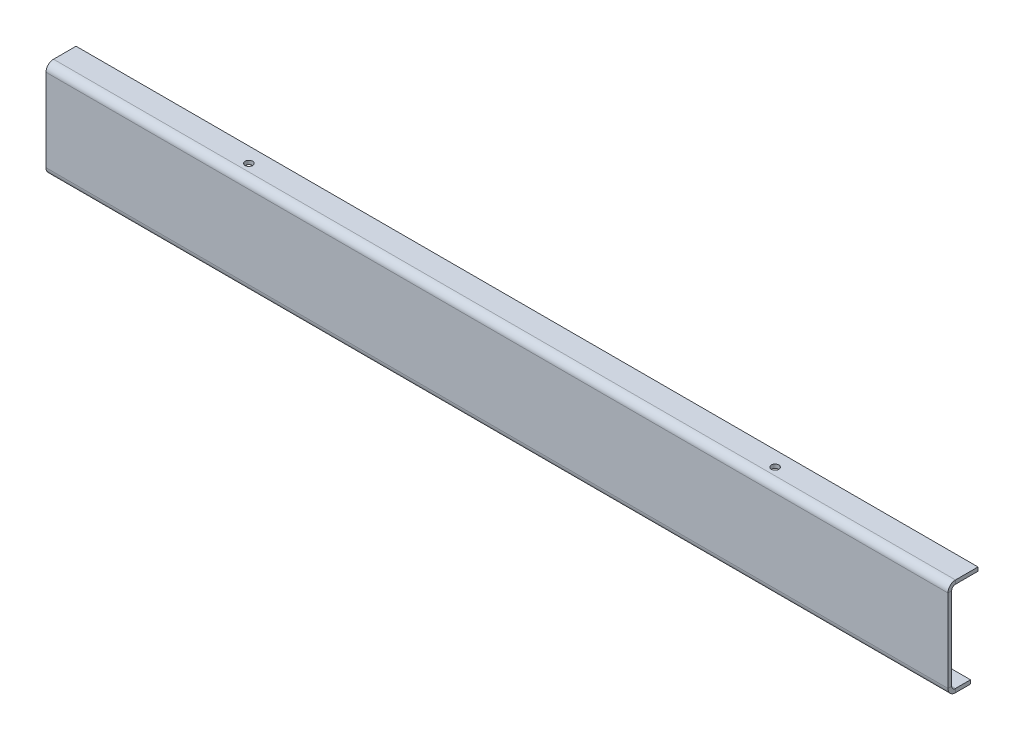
ISO-10303-21;
HEADER;
FILE_DESCRIPTION(('STEP AP214'),'2;1');
FILE_NAME('part.step','',(''),(''),'','','');
FILE_SCHEMA(('AUTOMOTIVE_DESIGN { 1 0 10303 214 1 1 1 1 }'));
ENDSEC;
DATA;
#1=APPLICATION_CONTEXT('core data for automotive mechanical design processes');
#2=APPLICATION_PROTOCOL_DEFINITION('international standard','automotive_design',2000,#1);
#3=PRODUCT_CONTEXT('',#1,'mechanical');
#4=PRODUCT('Part','Part','',(#3));
#5=PRODUCT_RELATED_PRODUCT_CATEGORY('part','',(#4));
#6=PRODUCT_DEFINITION_FORMATION('','',#4);
#7=PRODUCT_DEFINITION_CONTEXT('part definition',#1,'design');
#8=PRODUCT_DEFINITION('design','',#6,#7);
#9=PRODUCT_DEFINITION_SHAPE('','',#8);
#10=(LENGTH_UNIT() NAMED_UNIT(*) SI_UNIT(.MILLI.,.METRE.));
#11=(NAMED_UNIT(*) PLANE_ANGLE_UNIT() SI_UNIT($,.RADIAN.));
#12=(NAMED_UNIT(*) SI_UNIT($,.STERADIAN.) SOLID_ANGLE_UNIT());
#13=UNCERTAINTY_MEASURE_WITH_UNIT(LENGTH_MEASURE(1.E-05),#10,'distance_accuracy_value','');
#14=(GEOMETRIC_REPRESENTATION_CONTEXT(3) GLOBAL_UNCERTAINTY_ASSIGNED_CONTEXT((#13)) GLOBAL_UNIT_ASSIGNED_CONTEXT((#10,
#11,#12)) REPRESENTATION_CONTEXT('',''));
#15=CARTESIAN_POINT('',(0.,0.,0.));
#16=DIRECTION('',(0.,0.,1.));
#17=DIRECTION('',(1.,0.,0.));
#18=AXIS2_PLACEMENT_3D('',#15,#16,#17);
#19=CARTESIAN_POINT('',(299.999999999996,32.5000000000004,-19.9999999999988));
#20=DIRECTION('',(0.,-1.,0.));
#21=DIRECTION('',(0.,0.,-1.00000000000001));
#22=AXIS2_PLACEMENT_3D('',#19,#20,#21);
#23=PLANE('',#22);
#24=CARTESIAN_POINT('',(-175.000000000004,32.5,-10.000000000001));
#25=DIRECTION('',(0.,1.,0.));
#26=DIRECTION('',(0.,0.,1.00000000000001));
#27=AXIS2_PLACEMENT_3D('',#24,#25,#26);
#28=CIRCLE('',#27,2.5);
#29=CARTESIAN_POINT('',(-175.000000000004,32.5,-7.50000000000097));
#30=VERTEX_POINT('',#29);
#31=EDGE_CURVE('E627',#30,#30,#28,.T.);
#32=ORIENTED_EDGE('',*,*,#31,.F.);
#33=EDGE_LOOP('',(#32));
#34=FACE_BOUND('',#33,.T.);
#35=DIRECTION('',(0.,0.,1.00000000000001));
#36=VECTOR('',#35,1.);
#37=CARTESIAN_POINT('',(-300.000000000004,32.5000000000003,-20.0000000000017));
#38=LINE('',#37,#36);
#39=CARTESIAN_POINT('',(-300.000000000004,32.5000000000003,-20.0000000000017));
#40=VERTEX_POINT('',#39);
#41=CARTESIAN_POINT('',(-300.000000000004,32.5000000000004,-5.00000000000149));
#42=VERTEX_POINT('',#41);
#43=EDGE_CURVE('E187',#40,#42,#38,.T.);
#44=ORIENTED_EDGE('',*,*,#43,.T.);
#45=DIRECTION('',(-1.,0.,0.));
#46=VECTOR('',#45,1.);
#47=CARTESIAN_POINT('',(300.,32.5000000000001,-4.99999999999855));
#48=LINE('',#47,#46);
#49=CARTESIAN_POINT('',(300.,32.5000000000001,-4.99999999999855));
#50=VERTEX_POINT('',#49);
#51=EDGE_CURVE('E254',#50,#42,#48,.T.);
#52=ORIENTED_EDGE('',*,*,#51,.F.);
#53=DIRECTION('',(0.,0.,1.00000000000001));
#54=VECTOR('',#53,1.);
#55=CARTESIAN_POINT('',(299.999999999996,32.5000000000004,-19.9999999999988));
#56=LINE('',#55,#54);
#57=CARTESIAN_POINT('',(299.999999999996,32.5000000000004,-19.9999999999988));
#58=VERTEX_POINT('',#57);
#59=EDGE_CURVE('E230',#58,#50,#56,.T.);
#60=ORIENTED_EDGE('',*,*,#59,.F.);
#61=DIRECTION('',(-1.,0.,0.));
#62=VECTOR('',#61,1.);
#63=CARTESIAN_POINT('',(299.999999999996,32.5000000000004,-19.9999999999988));
#64=LINE('',#63,#62);
#65=EDGE_CURVE('E258',#58,#40,#64,.T.);
#66=ORIENTED_EDGE('',*,*,#65,.T.);
#67=EDGE_LOOP('',(#44,#52,#60,#66));
#68=FACE_BOUND('',#67,.T.);
#69=CARTESIAN_POINT('',(175.,32.5000000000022,-9.99999999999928));
#70=DIRECTION('',(0.,1.,0.));
#71=DIRECTION('',(0.,0.,1.00000000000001));
#72=AXIS2_PLACEMENT_3D('',#69,#70,#71);
#73=CIRCLE('',#72,2.5);
#74=CARTESIAN_POINT('',(175.,32.5000000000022,-7.49999999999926));
#75=VERTEX_POINT('',#74);
#76=EDGE_CURVE('E632',#75,#75,#73,.T.);
#77=ORIENTED_EDGE('',*,*,#76,.F.);
#78=EDGE_LOOP('',(#77));
#79=FACE_BOUND('',#78,.T.);
#80=ADVANCED_FACE('F42',(#34,#68,#79),#23,.F.);
#81=CARTESIAN_POINT('',(300.,32.5000000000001,-4.99999999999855));
#82=DIRECTION('',(1.,0.,0.));
#83=DIRECTION('',(0.,0.,-1.00000000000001));
#84=AXIS2_PLACEMENT_3D('',#81,#82,#83);
#85=PLANE('',#84);
#86=DIRECTION('',(0.,-1.,0.));
#87=VECTOR('',#86,1.);
#88=CARTESIAN_POINT('',(300.,32.5000000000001,-4.99999999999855));
#89=LINE('',#88,#87);
#90=CARTESIAN_POINT('',(300.,30.,-4.99999999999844));
#91=VERTEX_POINT('',#90);
#92=EDGE_CURVE('E11',#50,#91,#89,.T.);
#93=ORIENTED_EDGE('',*,*,#92,.F.);
#94=CARTESIAN_POINT('',(300.,27.5,-4.99999999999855));
#95=DIRECTION('',(-1.,0.,0.));
#96=DIRECTION('',(0.,0.,1.00000000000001));
#97=AXIS2_PLACEMENT_3D('',#94,#95,#96);
#98=CIRCLE('',#97,5.);
#99=CARTESIAN_POINT('',(300.,27.5000000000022,1.42247325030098E-12));
#100=VERTEX_POINT('',#99);
#101=EDGE_CURVE('E234',#50,#100,#98,.F.);
#102=ORIENTED_EDGE('',*,*,#101,.T.);
#103=DIRECTION('',(0.,0.,1.00000000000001));
#104=VECTOR('',#103,1.);
#105=CARTESIAN_POINT('',(300.,27.5000000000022,-2.49999999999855));
#106=LINE('',#105,#104);
#107=CARTESIAN_POINT('',(300.,27.5000000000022,-2.49999999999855));
#108=VERTEX_POINT('',#107);
#109=EDGE_CURVE('E51',#108,#100,#106,.T.);
#110=ORIENTED_EDGE('',*,*,#109,.F.);
#111=CARTESIAN_POINT('',(300.,27.5,-4.99999999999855));
#112=DIRECTION('',(1.,0.,0.));
#113=DIRECTION('',(0.,-1.,0.));
#114=AXIS2_PLACEMENT_3D('',#111,#112,#113);
#115=CIRCLE('',#114,2.5);
#116=EDGE_CURVE('E218',#91,#108,#115,.T.);
#117=ORIENTED_EDGE('',*,*,#116,.F.);
#118=EDGE_LOOP('',(#93,#102,#110,#117));
#119=FACE_BOUND('',#118,.T.);
#120=ADVANCED_FACE('F44',(#119),#85,.T.);
#121=CARTESIAN_POINT('',(300.,27.5000000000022,-2.49999999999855));
#122=DIRECTION('',(1.,0.,0.));
#123=DIRECTION('',(0.,0.,-1.00000000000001));
#124=AXIS2_PLACEMENT_3D('',#121,#122,#123);
#125=PLANE('',#124);
#126=ORIENTED_EDGE('',*,*,#59,.T.);
#127=ORIENTED_EDGE('',*,*,#92,.T.);
#128=DIRECTION('',(0.,0.,-1.00000000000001));
#129=VECTOR('',#128,1.);
#130=CARTESIAN_POINT('',(299.999999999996,30.0000000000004,-19.9999999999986));
#131=LINE('',#130,#129);
#132=CARTESIAN_POINT('',(299.999999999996,30.0000000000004,-19.9999999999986));
#133=VERTEX_POINT('',#132);
#134=EDGE_CURVE('E222',#133,#91,#131,.F.);
#135=ORIENTED_EDGE('',*,*,#134,.F.);
#136=DIRECTION('',(0.,-1.,0.));
#137=VECTOR('',#136,1.);
#138=CARTESIAN_POINT('',(299.999999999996,32.5000000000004,-19.9999999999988));
#139=LINE('',#138,#137);
#140=EDGE_CURVE('E226',#58,#133,#139,.T.);
#141=ORIENTED_EDGE('',*,*,#140,.F.);
#142=EDGE_LOOP('',(#126,#127,#135,#141));
#143=FACE_BOUND('',#142,.T.);
#144=ADVANCED_FACE('F339',(#143),#125,.T.);
#145=CARTESIAN_POINT('',(-300.000000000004,27.5000000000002,-1.45716771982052E-12));
#146=DIRECTION('',(-1.,0.,0.));
#147=DIRECTION('',(0.,0.,1.00000000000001));
#148=AXIS2_PLACEMENT_3D('',#145,#146,#147);
#149=PLANE('',#148);
#150=DIRECTION('',(0.,0.,-1.00000000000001));
#151=VECTOR('',#150,1.);
#152=CARTESIAN_POINT('',(-300.000000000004,27.5000000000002,-1.45716771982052E-12));
#153=LINE('',#152,#151);
#154=CARTESIAN_POINT('',(-300.000000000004,27.5000000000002,-1.45716771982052E-12));
#155=VERTEX_POINT('',#154);
#156=CARTESIAN_POINT('',(-300.000000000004,27.5000000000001,-2.50000000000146));
#157=VERTEX_POINT('',#156);
#158=EDGE_CURVE('E294',#155,#157,#153,.T.);
#159=ORIENTED_EDGE('',*,*,#158,.F.);
#160=CARTESIAN_POINT('',(-300.000000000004,27.5000000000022,-5.00000000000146));
#161=DIRECTION('',(-1.,0.,0.));
#162=DIRECTION('',(0.,0.,1.00000000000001));
#163=AXIS2_PLACEMENT_3D('',#160,#161,#162);
#164=CIRCLE('',#163,5.);
#165=EDGE_CURVE('E191',#42,#155,#164,.F.);
#166=ORIENTED_EDGE('',*,*,#165,.F.);
#167=DIRECTION('',(0.,1.,0.));
#168=VECTOR('',#167,1.);
#169=CARTESIAN_POINT('',(-300.000000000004,30.0000000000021,-5.00000000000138));
#170=LINE('',#169,#168);
#171=CARTESIAN_POINT('',(-300.000000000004,30.0000000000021,-5.00000000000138));
#172=VERTEX_POINT('',#171);
#173=EDGE_CURVE('E291',#172,#42,#170,.T.);
#174=ORIENTED_EDGE('',*,*,#173,.F.);
#175=CARTESIAN_POINT('',(-300.000000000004,27.5000000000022,-5.00000000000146));
#176=DIRECTION('',(1.,0.,0.));
#177=DIRECTION('',(0.,-1.,0.));
#178=AXIS2_PLACEMENT_3D('',#175,#176,#177);
#179=CIRCLE('',#178,2.5);
#180=EDGE_CURVE('E175',#172,#157,#179,.T.);
#181=ORIENTED_EDGE('',*,*,#180,.T.);
#182=EDGE_LOOP('',(#159,#166,#174,#181));
#183=FACE_BOUND('',#182,.T.);
#184=ADVANCED_FACE('F349',(#183),#149,.T.);
#185=CARTESIAN_POINT('',(-300.000000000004,30.0000000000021,-5.00000000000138));
#186=DIRECTION('',(-1.,0.,0.));
#187=DIRECTION('',(0.,0.,1.00000000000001));
#188=AXIS2_PLACEMENT_3D('',#185,#186,#187);
#189=PLANE('',#188);
#190=DIRECTION('',(0.,-1.,0.));
#191=VECTOR('',#190,1.);
#192=CARTESIAN_POINT('',(-300.000000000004,32.5000000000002,-1.48492329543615E-12));
#193=LINE('',#192,#191);
#194=CARTESIAN_POINT('',(-300.000000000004,-27.4999999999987,-1.37390099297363E-12));
#195=VERTEX_POINT('',#194);
#196=EDGE_CURVE('E195',#155,#195,#193,.T.);
#197=ORIENTED_EDGE('',*,*,#196,.F.);
#198=ORIENTED_EDGE('',*,*,#158,.T.);
#199=DIRECTION('',(0.,-1.,0.));
#200=VECTOR('',#199,1.);
#201=CARTESIAN_POINT('',(-300.000000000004,32.5000000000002,-2.50000000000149));
#202=LINE('',#201,#200);
#203=CARTESIAN_POINT('',(-300.000000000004,-27.4999999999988,-2.50000000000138));
#204=VERTEX_POINT('',#203);
#205=EDGE_CURVE('E171',#157,#204,#202,.T.);
#206=ORIENTED_EDGE('',*,*,#205,.T.);
#207=DIRECTION('',(0.,0.,1.00000000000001));
#208=VECTOR('',#207,1.);
#209=CARTESIAN_POINT('',(-300.000000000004,-27.4999999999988,-2.50000000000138));
#210=LINE('',#209,#208);
#211=EDGE_CURVE('E143',#204,#195,#210,.T.);
#212=ORIENTED_EDGE('',*,*,#211,.T.);
#213=EDGE_LOOP('',(#197,#198,#206,#212));
#214=FACE_BOUND('',#213,.T.);
#215=ADVANCED_FACE('F351',(#214),#189,.T.);
#216=CARTESIAN_POINT('',(300.,-27.4999999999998,1.5334955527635E-12));
#217=DIRECTION('',(1.,0.,0.));
#218=DIRECTION('',(0.,0.,-1.00000000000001));
#219=AXIS2_PLACEMENT_3D('',#216,#217,#218);
#220=PLANE('',#219);
#221=DIRECTION('',(0.,0.,-1.00000000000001));
#222=VECTOR('',#221,1.);
#223=CARTESIAN_POINT('',(300.,-27.4999999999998,1.5334955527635E-12));
#224=LINE('',#223,#222);
#225=CARTESIAN_POINT('',(300.,-27.4999999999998,1.5334955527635E-12));
#226=VERTEX_POINT('',#225);
#227=CARTESIAN_POINT('',(300.,-27.4999999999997,-2.49999999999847));
#228=VERTEX_POINT('',#227);
#229=EDGE_CURVE('E65',#226,#228,#224,.T.);
#230=ORIENTED_EDGE('',*,*,#229,.F.);
#231=CARTESIAN_POINT('',(300.,-27.4999999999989,-4.99999999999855));
#232=DIRECTION('',(-1.,0.,0.));
#233=DIRECTION('',(0.,0.,1.00000000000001));
#234=AXIS2_PLACEMENT_3D('',#231,#232,#233);
#235=CIRCLE('',#234,5.);
#236=CARTESIAN_POINT('',(300.,-32.4999999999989,-4.99999999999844));
#237=VERTEX_POINT('',#236);
#238=EDGE_CURVE('E241',#226,#237,#235,.F.);
#239=ORIENTED_EDGE('',*,*,#238,.T.);
#240=DIRECTION('',(0.,-1.,0.));
#241=VECTOR('',#240,1.);
#242=CARTESIAN_POINT('',(300.,-29.9999999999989,-4.99999999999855));
#243=LINE('',#242,#241);
#244=CARTESIAN_POINT('',(300.,-29.9999999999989,-4.99999999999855));
#245=VERTEX_POINT('',#244);
#246=EDGE_CURVE('E58',#245,#237,#243,.T.);
#247=ORIENTED_EDGE('',*,*,#246,.F.);
#248=CARTESIAN_POINT('',(300.,-27.4999999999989,-4.99999999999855));
#249=DIRECTION('',(1.,0.,0.));
#250=DIRECTION('',(0.,-1.,0.));
#251=AXIS2_PLACEMENT_3D('',#248,#249,#250);
#252=CIRCLE('',#251,2.5);
#253=EDGE_CURVE('E211',#228,#245,#252,.T.);
#254=ORIENTED_EDGE('',*,*,#253,.F.);
#255=EDGE_LOOP('',(#230,#239,#247,#254));
#256=FACE_BOUND('',#255,.T.);
#257=ADVANCED_FACE('F317',(#256),#220,.T.);
#258=CARTESIAN_POINT('',(300.,-29.9999999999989,-4.99999999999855));
#259=DIRECTION('',(1.,0.,0.));
#260=DIRECTION('',(0.,0.,-1.00000000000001));
#261=AXIS2_PLACEMENT_3D('',#258,#259,#260);
#262=PLANE('',#261);
#263=DIRECTION('',(0.,-1.,0.));
#264=VECTOR('',#263,1.);
#265=CARTESIAN_POINT('',(300.,32.5000000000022,1.42247325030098E-12));
#266=LINE('',#265,#264);
#267=EDGE_CURVE('E238',#100,#226,#266,.T.);
#268=ORIENTED_EDGE('',*,*,#267,.T.);
#269=ORIENTED_EDGE('',*,*,#229,.T.);
#270=DIRECTION('',(0.,-1.,0.));
#271=VECTOR('',#270,1.);
#272=CARTESIAN_POINT('',(300.,32.5000000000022,-2.49999999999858));
#273=LINE('',#272,#271);
#274=EDGE_CURVE('E214',#108,#228,#273,.T.);
#275=ORIENTED_EDGE('',*,*,#274,.F.);
#276=ORIENTED_EDGE('',*,*,#109,.T.);
#277=EDGE_LOOP('',(#268,#269,#275,#276));
#278=FACE_BOUND('',#277,.T.);
#279=ADVANCED_FACE('F299',(#278),#262,.T.);
#280=CARTESIAN_POINT('',(-300.000000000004,-32.4999999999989,-5.00000000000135));
#281=DIRECTION('',(-1.,0.,0.));
#282=DIRECTION('',(0.,0.,1.00000000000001));
#283=AXIS2_PLACEMENT_3D('',#280,#281,#282);
#284=PLANE('',#283);
#285=DIRECTION('',(0.,1.,0.));
#286=VECTOR('',#285,1.);
#287=CARTESIAN_POINT('',(-300.000000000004,-32.4999999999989,-5.00000000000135));
#288=LINE('',#287,#286);
#289=CARTESIAN_POINT('',(-300.000000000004,-32.4999999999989,-5.00000000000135));
#290=VERTEX_POINT('',#289);
#291=CARTESIAN_POINT('',(-300.000000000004,-29.9999999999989,-5.00000000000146));
#292=VERTEX_POINT('',#291);
#293=EDGE_CURVE('E284',#290,#292,#288,.T.);
#294=ORIENTED_EDGE('',*,*,#293,.F.);
#295=CARTESIAN_POINT('',(-300.000000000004,-27.4999999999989,-5.00000000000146));
#296=DIRECTION('',(-1.,0.,0.));
#297=DIRECTION('',(0.,0.,1.00000000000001));
#298=AXIS2_PLACEMENT_3D('',#295,#296,#297);
#299=CIRCLE('',#298,5.);
#300=EDGE_CURVE('E199',#195,#290,#299,.F.);
#301=ORIENTED_EDGE('',*,*,#300,.F.);
#302=ORIENTED_EDGE('',*,*,#211,.F.);
#303=CARTESIAN_POINT('',(-300.000000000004,-27.4999999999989,-5.00000000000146));
#304=DIRECTION('',(1.,0.,0.));
#305=DIRECTION('',(0.,-1.,0.));
#306=AXIS2_PLACEMENT_3D('',#303,#304,#305);
#307=CIRCLE('',#306,2.5);
#308=EDGE_CURVE('E164',#204,#292,#307,.T.);
#309=ORIENTED_EDGE('',*,*,#308,.T.);
#310=EDGE_LOOP('',(#294,#301,#302,#309));
#311=FACE_BOUND('',#310,.T.);
#312=ADVANCED_FACE('F353',(#311),#284,.T.);
#313=CARTESIAN_POINT('',(-300.000000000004,-27.4999999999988,-2.50000000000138));
#314=DIRECTION('',(-1.,0.,0.));
#315=DIRECTION('',(0.,0.,1.00000000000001));
#316=AXIS2_PLACEMENT_3D('',#313,#314,#315);
#317=PLANE('',#316);
#318=DIRECTION('',(0.,0.,-1.00000000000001));
#319=VECTOR('',#318,1.);
#320=CARTESIAN_POINT('',(-300.000000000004,-32.4999999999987,-1.346145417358E-12));
#321=LINE('',#320,#319);
#322=CARTESIAN_POINT('',(-300.000000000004,-32.4999999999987,-15.0000000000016));
#323=VERTEX_POINT('',#322);
#324=EDGE_CURVE('E148',#290,#323,#321,.T.);
#325=ORIENTED_EDGE('',*,*,#324,.F.);
#326=ORIENTED_EDGE('',*,*,#293,.T.);
#327=DIRECTION('',(0.,0.,-1.00000000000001));
#328=VECTOR('',#327,1.);
#329=CARTESIAN_POINT('',(-300.000000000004,-29.9999999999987,-1.45716771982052E-12));
#330=LINE('',#329,#328);
#331=CARTESIAN_POINT('',(-300.000000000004,-29.9999999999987,-15.0000000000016));
#332=VERTEX_POINT('',#331);
#333=EDGE_CURVE('E158',#292,#332,#330,.T.);
#334=ORIENTED_EDGE('',*,*,#333,.T.);
#335=DIRECTION('',(0.,-1.,0.));
#336=VECTOR('',#335,1.);
#337=CARTESIAN_POINT('',(-300.000000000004,-29.9999999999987,-15.0000000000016));
#338=LINE('',#337,#336);
#339=EDGE_CURVE('E136',#332,#323,#338,.T.);
#340=ORIENTED_EDGE('',*,*,#339,.T.);
#341=EDGE_LOOP('',(#325,#326,#334,#340));
#342=FACE_BOUND('',#341,.T.);
#343=ADVANCED_FACE('F156',(#342),#317,.T.);
#344=CARTESIAN_POINT('',(300.,-32.4999999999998,1.56125112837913E-12));
#345=DIRECTION('',(0.,1.,0.));
#346=DIRECTION('',(0.,0.,1.00000000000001));
#347=AXIS2_PLACEMENT_3D('',#344,#345,#346);
#348=PLANE('',#347);
#349=ORIENTED_EDGE('',*,*,#324,.T.);
#350=DIRECTION('',(-1.,0.,0.));
#351=VECTOR('',#350,1.);
#352=CARTESIAN_POINT('',(300.,-32.4999999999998,-14.9999999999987));
#353=LINE('',#352,#351);
#354=CARTESIAN_POINT('',(300.,-32.4999999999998,-14.9999999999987));
#355=VERTEX_POINT('',#354);
#356=EDGE_CURVE('E132',#355,#323,#353,.T.);
#357=ORIENTED_EDGE('',*,*,#356,.F.);
#358=DIRECTION('',(0.,0.,-1.00000000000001));
#359=VECTOR('',#358,1.);
#360=CARTESIAN_POINT('',(300.,-32.4999999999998,1.56125112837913E-12));
#361=LINE('',#360,#359);
#362=EDGE_CURVE('E203',#237,#355,#361,.T.);
#363=ORIENTED_EDGE('',*,*,#362,.F.);
#364=DIRECTION('',(-1.,0.,0.));
#365=VECTOR('',#364,1.);
#366=CARTESIAN_POINT('',(300.,-32.4999999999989,-4.99999999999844));
#367=LINE('',#366,#365);
#368=EDGE_CURVE('E151',#237,#290,#367,.T.);
#369=ORIENTED_EDGE('',*,*,#368,.T.);
#370=EDGE_LOOP('',(#349,#357,#363,#369));
#371=FACE_BOUND('',#370,.T.);
#372=ADVANCED_FACE('F149',(#371),#348,.F.);
#373=CARTESIAN_POINT('',(300.,-29.9999999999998,-14.9999999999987));
#374=DIRECTION('',(0.,0.,-1.00000000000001));
#375=DIRECTION('',(-1.,0.,0.));
#376=AXIS2_PLACEMENT_3D('',#373,#374,#375);
#377=PLANE('',#376);
#378=ORIENTED_EDGE('',*,*,#339,.F.);
#379=DIRECTION('',(-1.,0.,0.));
#380=VECTOR('',#379,1.);
#381=CARTESIAN_POINT('',(300.,-29.9999999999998,-14.9999999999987));
#382=LINE('',#381,#380);
#383=CARTESIAN_POINT('',(300.,-29.9999999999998,-14.9999999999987));
#384=VERTEX_POINT('',#383);
#385=EDGE_CURVE('E144',#384,#332,#382,.T.);
#386=ORIENTED_EDGE('',*,*,#385,.F.);
#387=DIRECTION('',(0.,-1.,0.));
#388=VECTOR('',#387,1.);
#389=CARTESIAN_POINT('',(300.,-29.9999999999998,-14.9999999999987));
#390=LINE('',#389,#388);
#391=EDGE_CURVE('E139',#384,#355,#390,.T.);
#392=ORIENTED_EDGE('',*,*,#391,.T.);
#393=ORIENTED_EDGE('',*,*,#356,.T.);
#394=EDGE_LOOP('',(#378,#386,#392,#393));
#395=FACE_BOUND('',#394,.T.);
#396=ADVANCED_FACE('F134',(#395),#377,.T.);
#397=CARTESIAN_POINT('',(300.,-29.9999999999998,1.45022882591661E-12));
#398=DIRECTION('',(0.,1.,0.));
#399=DIRECTION('',(0.,0.,1.00000000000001));
#400=AXIS2_PLACEMENT_3D('',#397,#398,#399);
#401=PLANE('',#400);
#402=ORIENTED_EDGE('',*,*,#333,.F.);
#403=DIRECTION('',(-1.,0.,0.));
#404=VECTOR('',#403,1.);
#405=CARTESIAN_POINT('',(300.,-29.9999999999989,-4.99999999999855));
#406=LINE('',#405,#404);
#407=EDGE_CURVE('E276',#245,#292,#406,.T.);
#408=ORIENTED_EDGE('',*,*,#407,.F.);
#409=DIRECTION('',(0.,0.,-1.00000000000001));
#410=VECTOR('',#409,1.);
#411=CARTESIAN_POINT('',(300.,-29.9999999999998,1.45022882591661E-12));
#412=LINE('',#411,#410);
#413=EDGE_CURVE('E207',#245,#384,#412,.T.);
#414=ORIENTED_EDGE('',*,*,#413,.T.);
#415=ORIENTED_EDGE('',*,*,#385,.T.);
#416=EDGE_LOOP('',(#402,#408,#414,#415));
#417=FACE_BOUND('',#416,.T.);
#418=ADVANCED_FACE('F320',(#417),#401,.T.);
#419=CARTESIAN_POINT('',(300.,-27.4999999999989,-4.99999999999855));
#420=DIRECTION('',(-1.,0.,0.));
#421=DIRECTION('',(0.,0.,1.00000000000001));
#422=AXIS2_PLACEMENT_3D('',#419,#420,#421);
#423=CYLINDRICAL_SURFACE('',#422,2.5);
#424=ORIENTED_EDGE('',*,*,#308,.F.);
#425=DIRECTION('',(-1.,0.,0.));
#426=VECTOR('',#425,1.);
#427=CARTESIAN_POINT('',(300.,-27.4999999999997,-2.49999999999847));
#428=LINE('',#427,#426);
#429=EDGE_CURVE('E272',#228,#204,#428,.T.);
#430=ORIENTED_EDGE('',*,*,#429,.F.);
#431=ORIENTED_EDGE('',*,*,#253,.T.);
#432=ORIENTED_EDGE('',*,*,#407,.T.);
#433=EDGE_LOOP('',(#424,#430,#431,#432));
#434=FACE_BOUND('',#433,.T.);
#435=ADVANCED_FACE('F325',(#434),#423,.F.);
#436=CARTESIAN_POINT('',(300.,32.5000000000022,-2.49999999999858));
#437=DIRECTION('',(0.,0.,-1.00000000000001));
#438=DIRECTION('',(-1.,0.,0.));
#439=AXIS2_PLACEMENT_3D('',#436,#437,#438);
#440=PLANE('',#439);
#441=ORIENTED_EDGE('',*,*,#205,.F.);
#442=DIRECTION('',(-1.,0.,0.));
#443=VECTOR('',#442,1.);
#444=CARTESIAN_POINT('',(300.,27.5000000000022,-2.49999999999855));
#445=LINE('',#444,#443);
#446=EDGE_CURVE('E268',#108,#157,#445,.T.);
#447=ORIENTED_EDGE('',*,*,#446,.F.);
#448=ORIENTED_EDGE('',*,*,#274,.T.);
#449=ORIENTED_EDGE('',*,*,#429,.T.);
#450=EDGE_LOOP('',(#441,#447,#448,#449));
#451=FACE_BOUND('',#450,.T.);
#452=ADVANCED_FACE('F328',(#451),#440,.T.);
#453=CARTESIAN_POINT('',(300.,27.5,-4.99999999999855));
#454=DIRECTION('',(-1.,0.,0.));
#455=DIRECTION('',(0.,0.,1.00000000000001));
#456=AXIS2_PLACEMENT_3D('',#453,#454,#455);
#457=CYLINDRICAL_SURFACE('',#456,2.5);
#458=ORIENTED_EDGE('',*,*,#180,.F.);
#459=DIRECTION('',(-1.,0.,0.));
#460=VECTOR('',#459,1.);
#461=CARTESIAN_POINT('',(300.,30.,-4.99999999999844));
#462=LINE('',#461,#460);
#463=EDGE_CURVE('E264',#91,#172,#462,.T.);
#464=ORIENTED_EDGE('',*,*,#463,.F.);
#465=ORIENTED_EDGE('',*,*,#116,.T.);
#466=ORIENTED_EDGE('',*,*,#446,.T.);
#467=EDGE_LOOP('',(#458,#464,#465,#466));
#468=FACE_BOUND('',#467,.T.);
#469=ADVANCED_FACE('F331',(#468),#457,.F.);
#470=CARTESIAN_POINT('',(299.999999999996,30.0000000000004,-19.9999999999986));
#471=DIRECTION('',(0.,-1.,0.));
#472=DIRECTION('',(0.,0.,-1.00000000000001));
#473=AXIS2_PLACEMENT_3D('',#470,#471,#472);
#474=PLANE('',#473);
#475=CARTESIAN_POINT('',(-175.000000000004,30.0000000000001,-10.000000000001));
#476=DIRECTION('',(0.,-1.,0.));
#477=DIRECTION('',(0.,0.,-1.00000000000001));
#478=AXIS2_PLACEMENT_3D('',#475,#476,#477);
#479=CIRCLE('',#478,2.5);
#480=CARTESIAN_POINT('',(-175.000000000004,30.0000000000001,-12.500000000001));
#481=VERTEX_POINT('',#480);
#482=EDGE_CURVE('E630',#481,#481,#479,.T.);
#483=ORIENTED_EDGE('',*,*,#482,.F.);
#484=EDGE_LOOP('',(#483));
#485=FACE_BOUND('',#484,.T.);
#486=CARTESIAN_POINT('',(175.,30.0000000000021,-9.99999999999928));
#487=DIRECTION('',(0.,-1.,0.));
#488=DIRECTION('',(0.,0.,-1.00000000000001));
#489=AXIS2_PLACEMENT_3D('',#486,#487,#488);
#490=CIRCLE('',#489,2.5);
#491=CARTESIAN_POINT('',(175.,30.0000000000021,-12.4999999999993));
#492=VERTEX_POINT('',#491);
#493=EDGE_CURVE('E154',#492,#492,#490,.T.);
#494=ORIENTED_EDGE('',*,*,#493,.F.);
#495=EDGE_LOOP('',(#494));
#496=FACE_BOUND('',#495,.T.);
#497=DIRECTION('',(0.,0.,-1.00000000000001));
#498=VECTOR('',#497,1.);
#499=CARTESIAN_POINT('',(-300.000000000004,30.0000000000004,-20.0000000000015));
#500=LINE('',#499,#498);
#501=CARTESIAN_POINT('',(-300.000000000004,30.0000000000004,-20.0000000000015));
#502=VERTEX_POINT('',#501);
#503=EDGE_CURVE('E179',#502,#172,#500,.F.);
#504=ORIENTED_EDGE('',*,*,#503,.F.);
#505=DIRECTION('',(-1.,0.,0.));
#506=VECTOR('',#505,1.);
#507=CARTESIAN_POINT('',(299.999999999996,30.0000000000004,-19.9999999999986));
#508=LINE('',#507,#506);
#509=EDGE_CURVE('E261',#133,#502,#508,.T.);
#510=ORIENTED_EDGE('',*,*,#509,.F.);
#511=ORIENTED_EDGE('',*,*,#134,.T.);
#512=ORIENTED_EDGE('',*,*,#463,.T.);
#513=EDGE_LOOP('',(#504,#510,#511,#512));
#514=FACE_BOUND('',#513,.T.);
#515=ADVANCED_FACE('F336',(#485,#496,#514),#474,.T.);
#516=CARTESIAN_POINT('',(299.999999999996,32.5000000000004,-19.9999999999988));
#517=DIRECTION('',(0.,0.,-1.00000000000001));
#518=DIRECTION('',(-1.,0.,0.));
#519=AXIS2_PLACEMENT_3D('',#516,#517,#518);
#520=PLANE('',#519);
#521=DIRECTION('',(0.,-1.,0.));
#522=VECTOR('',#521,1.);
#523=CARTESIAN_POINT('',(-300.000000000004,32.5000000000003,-20.0000000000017));
#524=LINE('',#523,#522);
#525=EDGE_CURVE('E183',#40,#502,#524,.T.);
#526=ORIENTED_EDGE('',*,*,#525,.F.);
#527=ORIENTED_EDGE('',*,*,#65,.F.);
#528=ORIENTED_EDGE('',*,*,#140,.T.);
#529=ORIENTED_EDGE('',*,*,#509,.T.);
#530=EDGE_LOOP('',(#526,#527,#528,#529));
#531=FACE_BOUND('',#530,.T.);
#532=ADVANCED_FACE('F342',(#531),#520,.T.);
#533=CARTESIAN_POINT('',(300.,27.5,-4.99999999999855));
#534=DIRECTION('',(-1.,0.,0.));
#535=DIRECTION('',(0.,0.,1.00000000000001));
#536=AXIS2_PLACEMENT_3D('',#533,#534,#535);
#537=CYLINDRICAL_SURFACE('',#536,5.);
#538=ORIENTED_EDGE('',*,*,#165,.T.);
#539=DIRECTION('',(-1.,0.,0.));
#540=VECTOR('',#539,1.);
#541=CARTESIAN_POINT('',(300.,27.5000000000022,1.42247325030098E-12));
#542=LINE('',#541,#540);
#543=EDGE_CURVE('E250',#100,#155,#542,.T.);
#544=ORIENTED_EDGE('',*,*,#543,.F.);
#545=ORIENTED_EDGE('',*,*,#101,.F.);
#546=ORIENTED_EDGE('',*,*,#51,.T.);
#547=EDGE_LOOP('',(#538,#544,#545,#546));
#548=FACE_BOUND('',#547,.T.);
#549=ADVANCED_FACE('F308',(#548),#537,.T.);
#550=CARTESIAN_POINT('',(300.,32.5000000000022,1.42247325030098E-12));
#551=DIRECTION('',(0.,0.,-1.00000000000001));
#552=DIRECTION('',(-1.,0.,0.));
#553=AXIS2_PLACEMENT_3D('',#550,#551,#552);
#554=PLANE('',#553);
#555=ORIENTED_EDGE('',*,*,#196,.T.);
#556=DIRECTION('',(-1.,0.,0.));
#557=VECTOR('',#556,1.);
#558=CARTESIAN_POINT('',(300.,-27.4999999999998,1.5334955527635E-12));
#559=LINE('',#558,#557);
#560=EDGE_CURVE('E246',#226,#195,#559,.T.);
#561=ORIENTED_EDGE('',*,*,#560,.F.);
#562=ORIENTED_EDGE('',*,*,#267,.F.);
#563=ORIENTED_EDGE('',*,*,#543,.T.);
#564=EDGE_LOOP('',(#555,#561,#562,#563));
#565=FACE_BOUND('',#564,.T.);
#566=ADVANCED_FACE('F312',(#565),#554,.F.);
#567=CARTESIAN_POINT('',(300.,-27.4999999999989,-4.99999999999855));
#568=DIRECTION('',(-1.,0.,0.));
#569=DIRECTION('',(0.,0.,1.00000000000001));
#570=AXIS2_PLACEMENT_3D('',#567,#568,#569);
#571=CYLINDRICAL_SURFACE('',#570,5.);
#572=ORIENTED_EDGE('',*,*,#300,.T.);
#573=ORIENTED_EDGE('',*,*,#368,.F.);
#574=ORIENTED_EDGE('',*,*,#238,.F.);
#575=ORIENTED_EDGE('',*,*,#560,.T.);
#576=EDGE_LOOP('',(#572,#573,#574,#575));
#577=FACE_BOUND('',#576,.T.);
#578=ADVANCED_FACE('F316',(#577),#571,.T.);
#579=CARTESIAN_POINT('',(300.,-27.4999999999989,-4.99999999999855));
#580=DIRECTION('',(1.,0.,0.));
#581=DIRECTION('',(0.,0.,-1.00000000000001));
#582=AXIS2_PLACEMENT_3D('',#579,#580,#581);
#583=PLANE('',#582);
#584=ORIENTED_EDGE('',*,*,#362,.T.);
#585=ORIENTED_EDGE('',*,*,#391,.F.);
#586=ORIENTED_EDGE('',*,*,#413,.F.);
#587=ORIENTED_EDGE('',*,*,#246,.T.);
#588=EDGE_LOOP('',(#584,#585,#586,#587));
#589=FACE_BOUND('',#588,.T.);
#590=ADVANCED_FACE('F323',(#589),#583,.T.);
#591=CARTESIAN_POINT('',(-300.000000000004,-27.4999999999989,-5.00000000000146));
#592=DIRECTION('',(1.,0.,0.));
#593=DIRECTION('',(0.,0.,-1.00000000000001));
#594=AXIS2_PLACEMENT_3D('',#591,#592,#593);
#595=PLANE('',#594);
#596=ORIENTED_EDGE('',*,*,#503,.T.);
#597=ORIENTED_EDGE('',*,*,#173,.T.);
#598=ORIENTED_EDGE('',*,*,#43,.F.);
#599=ORIENTED_EDGE('',*,*,#525,.T.);
#600=EDGE_LOOP('',(#596,#597,#598,#599));
#601=FACE_BOUND('',#600,.T.);
#602=ADVANCED_FACE('F442',(#601),#595,.F.);
#603=CARTESIAN_POINT('',(175.,32.5000000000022,-9.99999999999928));
#604=DIRECTION('',(0.,1.,0.));
#605=DIRECTION('',(0.,0.,1.00000000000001));
#606=AXIS2_PLACEMENT_3D('',#603,#604,#605);
#607=CYLINDRICAL_SURFACE('',#606,2.5);
#608=ORIENTED_EDGE('',*,*,#76,.T.);
#609=EDGE_LOOP('',(#608));
#610=FACE_BOUND('',#609,.T.);
#611=ORIENTED_EDGE('',*,*,#493,.T.);
#612=EDGE_LOOP('',(#611));
#613=FACE_BOUND('',#612,.T.);
#614=ADVANCED_FACE('F449',(#610,#613),#607,.F.);
#615=CARTESIAN_POINT('',(-175.000000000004,32.5,-10.000000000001));
#616=DIRECTION('',(0.,1.,0.));
#617=DIRECTION('',(0.,0.,1.00000000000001));
#618=AXIS2_PLACEMENT_3D('',#615,#616,#617);
#619=CYLINDRICAL_SURFACE('',#618,2.5);
#620=ORIENTED_EDGE('',*,*,#31,.T.);
#621=EDGE_LOOP('',(#620));
#622=FACE_BOUND('',#621,.T.);
#623=ORIENTED_EDGE('',*,*,#482,.T.);
#624=EDGE_LOOP('',(#623));
#625=FACE_BOUND('',#624,.T.);
#626=ADVANCED_FACE('F458',(#622,#625),#619,.F.);
#627=CLOSED_SHELL('',(#80,#120,#144,#184,#215,#257,#279,#312,#343,#372,#396,#418,#435,#452,#469,
#515,#532,#549,#566,#578,#590,#602,#614,#626));
#628=MANIFOLD_SOLID_BREP('B2',#627);
#629=ADVANCED_BREP_SHAPE_REPRESENTATION('',(#18,#628),#14);
#630=SHAPE_DEFINITION_REPRESENTATION(#9,#629);
ENDSEC;
END-ISO-10303-21;
